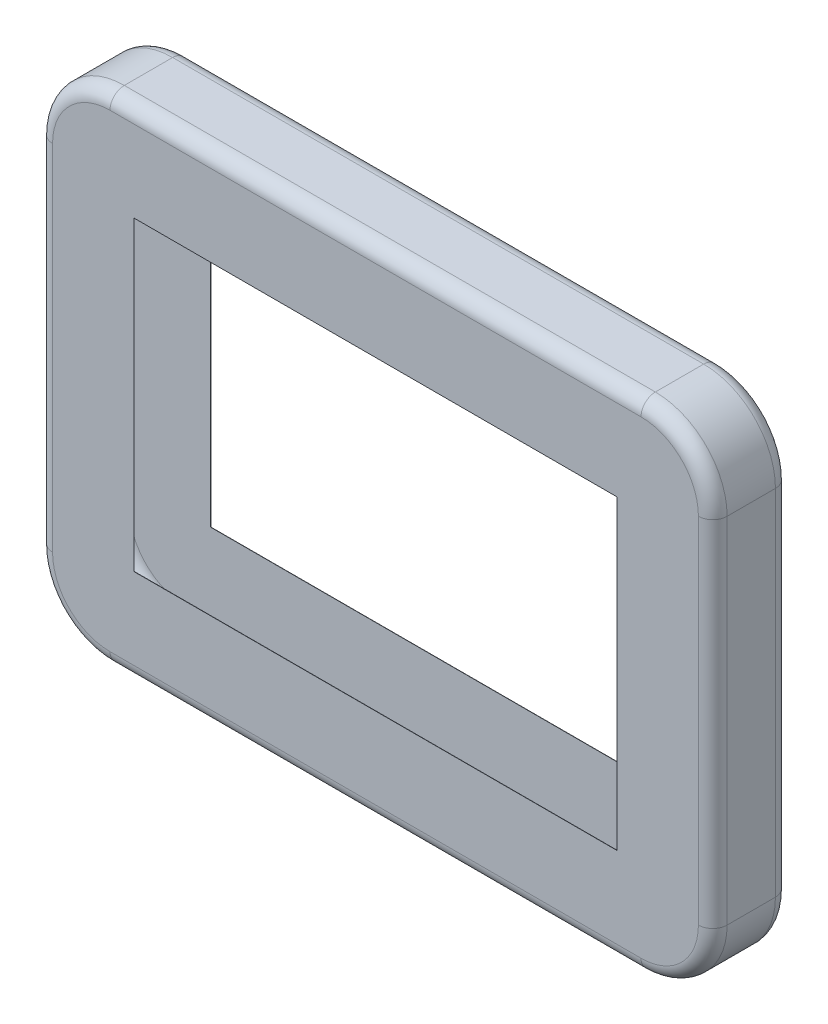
from build123d import *

# Parameters (mm, degrees)
ESQUISSE1_W        = 202
ESQUISSE1_H        = 128
EXTRU_MINCE1_DEPTH = 32.2
CONG_1_R           = 6
COQUE1_T           = -0.1


with BuildPart() as part:
    # Esquisse1 → Extru.-Mince1 (new body)
    with BuildSketch(Plane.XY):
        with BuildLine():
            Line((-141, -74), (-141, 74))
            ThreePointArc((-141, 74), (-132.213203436, 95.213203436), (-111, 104))
            Line((-111, 104), (111, 104))
            ThreePointArc((111, 104), (132.213203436, 95.213203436), (141, 74))
            Line((141, 74), (141, -74))
            ThreePointArc((141, -74), (132.213203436, -95.213203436), (111, -104))
            Line((111, -104), (-111, -104))
            ThreePointArc((-111, -104), (-132.213203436, -95.213203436), (-141, -74))
        make_face()
        Rectangle(ESQUISSE1_W, ESQUISSE1_H, mode=Mode.SUBTRACT)
    extrude(amount=EXTRU_MINCE1_DEPTH)

    # Cong_1
    cong_1_edges = [part.edges().sort_by_distance(p)[0] for p in [
        (-132.213203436, -95.213203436, 32.2),
        (0, -104, 32.2),
        (132.213203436, -95.213203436, 32.2),
        (141, 0, 32.2),
        (132.213203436, 95.213203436, 32.2),
        (0, 104, 32.2),
        (-132.213203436, 95.213203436, 32.2),
        (0, 104, 0),
        (132.213203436, 95.213203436, 0),
        (141, 0, 0),
        (132.213203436, -95.213203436, 0),
        (0, -104, 0),
        (-132.213203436, -95.213203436, 0),
        (-141, 0, 0),
        (-132.213203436, 95.213203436, 0),
        (-141, 0, 32.2),
    ]]
    fillet(cong_1_edges, radius=CONG_1_R)

    # Coque1
    coque1_openings = [part.faces().sort_by_distance(p)[0] for p in [
        (-101, 0, 16.1),
        (0, -64, 16.1),
        (101, 0, 16.1),
        (0, 64, 16.1),
    ]]
    offset(amount=COQUE1_T, openings=coque1_openings, kind=Kind.INTERSECTION)


solid = part.part
